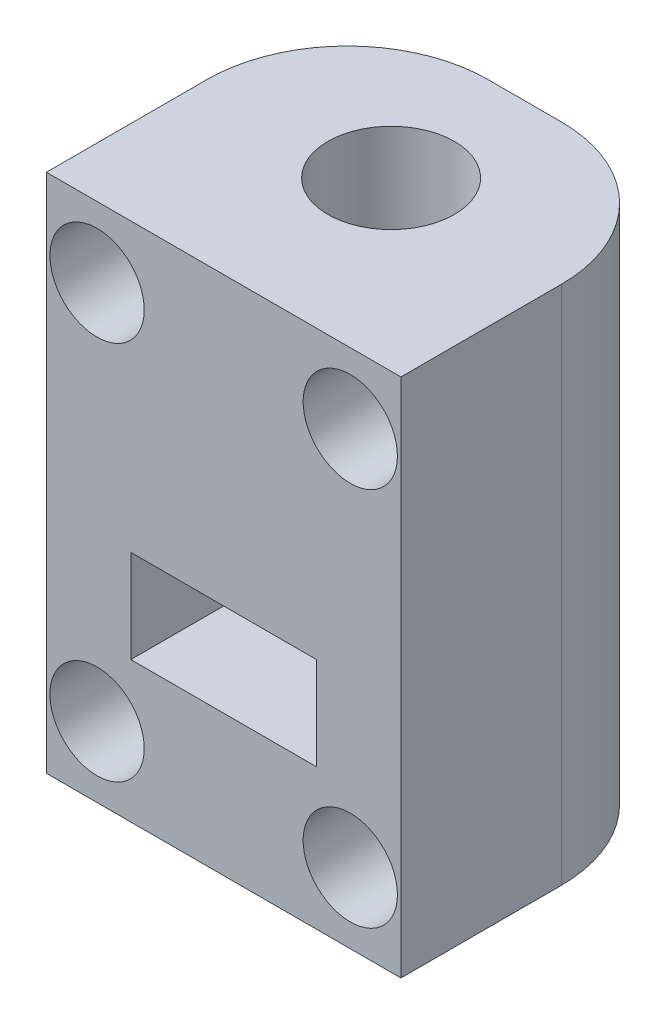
ISO-10303-21;
HEADER;
FILE_DESCRIPTION(('STEP AP214'),'2;1');
FILE_NAME('part.step','',(''),(''),'','','');
FILE_SCHEMA(('AUTOMOTIVE_DESIGN { 1 0 10303 214 1 1 1 1 }'));
ENDSEC;
DATA;
#1=APPLICATION_CONTEXT('core data for automotive mechanical design processes');
#2=APPLICATION_PROTOCOL_DEFINITION('international standard','automotive_design',2000,#1);
#3=PRODUCT_CONTEXT('',#1,'mechanical');
#4=PRODUCT('Part','Part','',(#3));
#5=PRODUCT_RELATED_PRODUCT_CATEGORY('part','',(#4));
#6=PRODUCT_DEFINITION_FORMATION('','',#4);
#7=PRODUCT_DEFINITION_CONTEXT('part definition',#1,'design');
#8=PRODUCT_DEFINITION('design','',#6,#7);
#9=PRODUCT_DEFINITION_SHAPE('','',#8);
#10=(LENGTH_UNIT() NAMED_UNIT(*) SI_UNIT(.MILLI.,.METRE.));
#11=(NAMED_UNIT(*) PLANE_ANGLE_UNIT() SI_UNIT($,.RADIAN.));
#12=(NAMED_UNIT(*) SI_UNIT($,.STERADIAN.) SOLID_ANGLE_UNIT());
#13=UNCERTAINTY_MEASURE_WITH_UNIT(LENGTH_MEASURE(1.E-05),#10,'distance_accuracy_value','');
#14=(GEOMETRIC_REPRESENTATION_CONTEXT(3) GLOBAL_UNCERTAINTY_ASSIGNED_CONTEXT((#13)) GLOBAL_UNIT_ASSIGNED_CONTEXT((#10,
#11,#12)) REPRESENTATION_CONTEXT('',''));
#15=CARTESIAN_POINT('',(0.,0.,0.));
#16=DIRECTION('',(0.,0.,1.));
#17=DIRECTION('',(1.,0.,0.));
#18=AXIS2_PLACEMENT_3D('',#15,#16,#17);
#19=CARTESIAN_POINT('',(0.,0.,21.4));
#20=DIRECTION('',(0.,0.,-1.));
#21=DIRECTION('',(-1.,0.,0.));
#22=AXIS2_PLACEMENT_3D('',#19,#20,#21);
#23=PLANE('',#22);
#24=CARTESIAN_POINT('',(21.6,5.,21.4));
#25=DIRECTION('',(0.,0.,1.));
#26=DIRECTION('',(1.,0.,0.));
#27=AXIS2_PLACEMENT_3D('',#24,#25,#26);
#28=CIRCLE('',#27,3.35);
#29=CARTESIAN_POINT('',(24.95,5.,21.4));
#30=VERTEX_POINT('',#29);
#31=EDGE_CURVE('E274',#30,#30,#28,.T.);
#32=ORIENTED_EDGE('',*,*,#31,.F.);
#33=EDGE_LOOP('',(#32));
#34=FACE_BOUND('',#33,.T.);
#35=CARTESIAN_POINT('',(3.6,5.,21.4));
#36=DIRECTION('',(0.,0.,1.));
#37=DIRECTION('',(1.,0.,0.));
#38=AXIS2_PLACEMENT_3D('',#35,#36,#37);
#39=CIRCLE('',#38,3.35);
#40=CARTESIAN_POINT('',(6.95,5.,21.4));
#41=VERTEX_POINT('',#40);
#42=EDGE_CURVE('E268',#41,#41,#39,.T.);
#43=ORIENTED_EDGE('',*,*,#42,.F.);
#44=EDGE_LOOP('',(#43));
#45=FACE_BOUND('',#44,.T.);
#46=CARTESIAN_POINT('',(21.6,32.,21.4));
#47=DIRECTION('',(0.,0.,1.));
#48=DIRECTION('',(1.,0.,0.));
#49=AXIS2_PLACEMENT_3D('',#46,#47,#48);
#50=CIRCLE('',#49,3.35);
#51=CARTESIAN_POINT('',(24.95,32.,21.4));
#52=VERTEX_POINT('',#51);
#53=EDGE_CURVE('E262',#52,#52,#50,.T.);
#54=ORIENTED_EDGE('',*,*,#53,.F.);
#55=EDGE_LOOP('',(#54));
#56=FACE_BOUND('',#55,.T.);
#57=CARTESIAN_POINT('',(3.6,32.,21.4));
#58=DIRECTION('',(0.,0.,1.));
#59=DIRECTION('',(1.,0.,0.));
#60=AXIS2_PLACEMENT_3D('',#57,#58,#59);
#61=CIRCLE('',#60,3.35);
#62=CARTESIAN_POINT('',(6.95,32.,21.4));
#63=VERTEX_POINT('',#62);
#64=EDGE_CURVE('E256',#63,#63,#61,.T.);
#65=ORIENTED_EDGE('',*,*,#64,.F.);
#66=EDGE_LOOP('',(#65));
#67=FACE_BOUND('',#66,.T.);
#68=DIRECTION('',(0.,-1.,0.));
#69=VECTOR('',#68,1.);
#70=CARTESIAN_POINT('',(0.,0.,21.4));
#71=LINE('',#70,#69);
#72=CARTESIAN_POINT('',(0.,37.,21.4));
#73=VERTEX_POINT('',#72);
#74=CARTESIAN_POINT('',(0.,0.,21.4));
#75=VERTEX_POINT('',#74);
#76=EDGE_CURVE('E169',#73,#75,#71,.T.);
#77=ORIENTED_EDGE('',*,*,#76,.T.);
#78=DIRECTION('',(1.,0.,0.));
#79=VECTOR('',#78,1.);
#80=CARTESIAN_POINT('',(0.,0.,21.4));
#81=LINE('',#80,#79);
#82=CARTESIAN_POINT('',(25.2,0.,21.4));
#83=VERTEX_POINT('',#82);
#84=EDGE_CURVE('E172',#75,#83,#81,.T.);
#85=ORIENTED_EDGE('',*,*,#84,.T.);
#86=DIRECTION('',(0.,1.,0.));
#87=VECTOR('',#86,1.);
#88=CARTESIAN_POINT('',(25.2,0.,21.4));
#89=LINE('',#88,#87);
#90=CARTESIAN_POINT('',(25.2,37.,21.4));
#91=VERTEX_POINT('',#90);
#92=EDGE_CURVE('E175',#83,#91,#89,.T.);
#93=ORIENTED_EDGE('',*,*,#92,.T.);
#94=DIRECTION('',(-1.,0.,0.));
#95=VECTOR('',#94,1.);
#96=CARTESIAN_POINT('',(0.,37.,21.4));
#97=LINE('',#96,#95);
#98=EDGE_CURVE('E177',#91,#73,#97,.T.);
#99=ORIENTED_EDGE('',*,*,#98,.T.);
#100=EDGE_LOOP('',(#77,#85,#93,#99));
#101=FACE_BOUND('',#100,.T.);
#102=DIRECTION('',(-1.,0.,0.));
#103=VECTOR('',#102,1.);
#104=CARTESIAN_POINT('',(0.,16.6,21.4));
#105=LINE('',#104,#103);
#106=CARTESIAN_POINT('',(19.2,16.6,21.4));
#107=VERTEX_POINT('',#106);
#108=CARTESIAN_POINT('',(5.99999999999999,16.6,21.4));
#109=VERTEX_POINT('',#108);
#110=EDGE_CURVE('E128',#107,#109,#105,.T.);
#111=ORIENTED_EDGE('',*,*,#110,.F.);
#112=DIRECTION('',(0.,-1.,0.));
#113=VECTOR('',#112,1.);
#114=CARTESIAN_POINT('',(19.2,0.,21.4));
#115=LINE('',#114,#113);
#116=CARTESIAN_POINT('',(19.2,10.,21.4));
#117=VERTEX_POINT('',#116);
#118=EDGE_CURVE('E198',#107,#117,#115,.T.);
#119=ORIENTED_EDGE('',*,*,#118,.T.);
#120=DIRECTION('',(-1.,0.,0.));
#121=VECTOR('',#120,1.);
#122=CARTESIAN_POINT('',(0.,10.,21.4));
#123=LINE('',#122,#121);
#124=CARTESIAN_POINT('',(5.99999999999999,10.,21.4));
#125=VERTEX_POINT('',#124);
#126=EDGE_CURVE('E162',#117,#125,#123,.T.);
#127=ORIENTED_EDGE('',*,*,#126,.T.);
#128=DIRECTION('',(0.,1.,0.));
#129=VECTOR('',#128,1.);
#130=CARTESIAN_POINT('',(6.,0.,21.4));
#131=LINE('',#130,#129);
#132=EDGE_CURVE('E194',#125,#109,#131,.T.);
#133=ORIENTED_EDGE('',*,*,#132,.T.);
#134=EDGE_LOOP('',(#111,#119,#127,#133));
#135=FACE_BOUND('',#134,.T.);
#136=ADVANCED_FACE('F35',(#34,#45,#56,#67,#101,#135),#23,.F.);
#137=CARTESIAN_POINT('',(0.,0.,21.4));
#138=DIRECTION('',(1.,0.,0.));
#139=DIRECTION('',(0.,0.,-1.));
#140=AXIS2_PLACEMENT_3D('',#137,#138,#139);
#141=PLANE('',#140);
#142=DIRECTION('',(0.,0.,-1.));
#143=VECTOR('',#142,1.);
#144=CARTESIAN_POINT('',(0.,37.,21.4));
#145=LINE('',#144,#143);
#146=CARTESIAN_POINT('',(0.,37.,10.));
#147=VERTEX_POINT('',#146);
#148=EDGE_CURVE('E179',#73,#147,#145,.T.);
#149=ORIENTED_EDGE('',*,*,#148,.T.);
#150=DIRECTION('',(0.,-1.,0.));
#151=VECTOR('',#150,1.);
#152=CARTESIAN_POINT('',(0.,0.,10.));
#153=LINE('',#152,#151);
#154=CARTESIAN_POINT('',(0.,0.,10.));
#155=VERTEX_POINT('',#154);
#156=EDGE_CURVE('E201',#147,#155,#153,.T.);
#157=ORIENTED_EDGE('',*,*,#156,.T.);
#158=DIRECTION('',(0.,0.,-1.));
#159=VECTOR('',#158,1.);
#160=CARTESIAN_POINT('',(0.,0.,21.4));
#161=LINE('',#160,#159);
#162=EDGE_CURVE('E191',#75,#155,#161,.T.);
#163=ORIENTED_EDGE('',*,*,#162,.F.);
#164=ORIENTED_EDGE('',*,*,#76,.F.);
#165=EDGE_LOOP('',(#149,#157,#163,#164));
#166=FACE_BOUND('',#165,.T.);
#167=ADVANCED_FACE('F223',(#166),#141,.F.);
#168=CARTESIAN_POINT('',(0.,0.,21.4));
#169=DIRECTION('',(0.,1.,0.));
#170=DIRECTION('',(0.,0.,1.));
#171=AXIS2_PLACEMENT_3D('',#168,#169,#170);
#172=PLANE('',#171);
#173=CARTESIAN_POINT('',(12.6,0.,9.5));
#174=DIRECTION('',(0.,-1.,0.));
#175=DIRECTION('',(0.,0.,-1.));
#176=AXIS2_PLACEMENT_3D('',#173,#174,#175);
#177=CIRCLE('',#176,4.5);
#178=CARTESIAN_POINT('',(12.6,0.,5.));
#179=VERTEX_POINT('',#178);
#180=EDGE_CURVE('E250',#179,#179,#177,.T.);
#181=ORIENTED_EDGE('',*,*,#180,.F.);
#182=EDGE_LOOP('',(#181));
#183=FACE_BOUND('',#182,.T.);
#184=ORIENTED_EDGE('',*,*,#162,.T.);
#185=CARTESIAN_POINT('',(10.,0.,10.));
#186=DIRECTION('',(0.,1.,0.));
#187=DIRECTION('',(0.,0.,1.));
#188=AXIS2_PLACEMENT_3D('',#185,#186,#187);
#189=CIRCLE('',#188,10.);
#190=CARTESIAN_POINT('',(10.,0.,0.));
#191=VERTEX_POINT('',#190);
#192=EDGE_CURVE('E209',#155,#191,#189,.F.);
#193=ORIENTED_EDGE('',*,*,#192,.T.);
#194=DIRECTION('',(1.,0.,0.));
#195=VECTOR('',#194,1.);
#196=CARTESIAN_POINT('',(0.,0.,0.));
#197=LINE('',#196,#195);
#198=CARTESIAN_POINT('',(15.2,0.,0.));
#199=VERTEX_POINT('',#198);
#200=EDGE_CURVE('E168',#191,#199,#197,.T.);
#201=ORIENTED_EDGE('',*,*,#200,.T.);
#202=CARTESIAN_POINT('',(15.2,0.,10.));
#203=DIRECTION('',(0.,1.,0.));
#204=DIRECTION('',(0.,0.,1.));
#205=AXIS2_PLACEMENT_3D('',#202,#203,#204);
#206=CIRCLE('',#205,10.);
#207=CARTESIAN_POINT('',(25.2,0.,10.));
#208=VERTEX_POINT('',#207);
#209=EDGE_CURVE('E207',#199,#208,#206,.F.);
#210=ORIENTED_EDGE('',*,*,#209,.T.);
#211=DIRECTION('',(0.,0.,-1.));
#212=VECTOR('',#211,1.);
#213=CARTESIAN_POINT('',(25.2,0.,21.4));
#214=LINE('',#213,#212);
#215=EDGE_CURVE('E188',#83,#208,#214,.T.);
#216=ORIENTED_EDGE('',*,*,#215,.F.);
#217=ORIENTED_EDGE('',*,*,#84,.F.);
#218=EDGE_LOOP('',(#184,#193,#201,#210,#216,#217));
#219=FACE_BOUND('',#218,.T.);
#220=ADVANCED_FACE('F227',(#183,#219),#172,.F.);
#221=CARTESIAN_POINT('',(25.2,0.,21.4));
#222=DIRECTION('',(-1.,0.,0.));
#223=DIRECTION('',(0.,0.,1.));
#224=AXIS2_PLACEMENT_3D('',#221,#222,#223);
#225=PLANE('',#224);
#226=ORIENTED_EDGE('',*,*,#215,.T.);
#227=DIRECTION('',(0.,1.,0.));
#228=VECTOR('',#227,1.);
#229=CARTESIAN_POINT('',(25.2,37.,10.));
#230=LINE('',#229,#228);
#231=CARTESIAN_POINT('',(25.2,37.,10.));
#232=VERTEX_POINT('',#231);
#233=EDGE_CURVE('E11',#208,#232,#230,.T.);
#234=ORIENTED_EDGE('',*,*,#233,.T.);
#235=DIRECTION('',(0.,0.,-1.));
#236=VECTOR('',#235,1.);
#237=CARTESIAN_POINT('',(25.2,37.,21.4));
#238=LINE('',#237,#236);
#239=EDGE_CURVE('E185',#91,#232,#238,.T.);
#240=ORIENTED_EDGE('',*,*,#239,.F.);
#241=ORIENTED_EDGE('',*,*,#92,.F.);
#242=EDGE_LOOP('',(#226,#234,#240,#241));
#243=FACE_BOUND('',#242,.T.);
#244=ADVANCED_FACE('F233',(#243),#225,.F.);
#245=CARTESIAN_POINT('',(0.,37.,21.4));
#246=DIRECTION('',(0.,-1.,0.));
#247=DIRECTION('',(0.,0.,-1.));
#248=AXIS2_PLACEMENT_3D('',#245,#246,#247);
#249=PLANE('',#248);
#250=CARTESIAN_POINT('',(12.6,37.,9.5));
#251=DIRECTION('',(0.,-1.,0.));
#252=DIRECTION('',(0.,0.,-1.));
#253=AXIS2_PLACEMENT_3D('',#250,#251,#252);
#254=CIRCLE('',#253,4.5);
#255=CARTESIAN_POINT('',(12.6,37.,5.));
#256=VERTEX_POINT('',#255);
#257=EDGE_CURVE('E204',#256,#256,#254,.T.);
#258=ORIENTED_EDGE('',*,*,#257,.T.);
#259=EDGE_LOOP('',(#258));
#260=FACE_BOUND('',#259,.T.);
#261=DIRECTION('',(-1.,0.,0.));
#262=VECTOR('',#261,1.);
#263=CARTESIAN_POINT('',(0.,37.,0.));
#264=LINE('',#263,#262);
#265=CARTESIAN_POINT('',(15.2,37.,0.));
#266=VERTEX_POINT('',#265);
#267=CARTESIAN_POINT('',(10.,37.,0.));
#268=VERTEX_POINT('',#267);
#269=EDGE_CURVE('E173',#266,#268,#264,.T.);
#270=ORIENTED_EDGE('',*,*,#269,.T.);
#271=CARTESIAN_POINT('',(10.,37.,10.));
#272=DIRECTION('',(0.,-1.,0.));
#273=DIRECTION('',(0.,0.,-1.));
#274=AXIS2_PLACEMENT_3D('',#271,#272,#273);
#275=CIRCLE('',#274,10.);
#276=EDGE_CURVE('E43',#268,#147,#275,.F.);
#277=ORIENTED_EDGE('',*,*,#276,.T.);
#278=ORIENTED_EDGE('',*,*,#148,.F.);
#279=ORIENTED_EDGE('',*,*,#98,.F.);
#280=ORIENTED_EDGE('',*,*,#239,.T.);
#281=CARTESIAN_POINT('',(15.2,37.,10.));
#282=DIRECTION('',(0.,-1.,0.));
#283=DIRECTION('',(0.,0.,-1.));
#284=AXIS2_PLACEMENT_3D('',#281,#282,#283);
#285=CIRCLE('',#284,10.);
#286=EDGE_CURVE('E50',#232,#266,#285,.F.);
#287=ORIENTED_EDGE('',*,*,#286,.T.);
#288=EDGE_LOOP('',(#270,#277,#278,#279,#280,#287));
#289=FACE_BOUND('',#288,.T.);
#290=ADVANCED_FACE('F217',(#260,#289),#249,.F.);
#291=CARTESIAN_POINT('',(0.,0.,0.));
#292=DIRECTION('',(0.,0.,-1.));
#293=DIRECTION('',(-1.,0.,0.));
#294=AXIS2_PLACEMENT_3D('',#291,#292,#293);
#295=PLANE('',#294);
#296=ORIENTED_EDGE('',*,*,#200,.F.);
#297=DIRECTION('',(0.,-1.,0.));
#298=VECTOR('',#297,1.);
#299=CARTESIAN_POINT('',(10.,37.,0.));
#300=LINE('',#299,#298);
#301=EDGE_CURVE('E57',#191,#268,#300,.F.);
#302=ORIENTED_EDGE('',*,*,#301,.T.);
#303=ORIENTED_EDGE('',*,*,#269,.F.);
#304=DIRECTION('',(0.,1.,0.));
#305=VECTOR('',#304,1.);
#306=CARTESIAN_POINT('',(15.2,0.,0.));
#307=LINE('',#306,#305);
#308=EDGE_CURVE('E211',#266,#199,#307,.F.);
#309=ORIENTED_EDGE('',*,*,#308,.T.);
#310=EDGE_LOOP('',(#296,#302,#303,#309));
#311=FACE_BOUND('',#310,.T.);
#312=ADVANCED_FACE('F229',(#311),#295,.T.);
#313=CARTESIAN_POINT('',(19.2,16.6,5.68948822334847));
#314=DIRECTION('',(1.,0.,0.));
#315=DIRECTION('',(0.,0.,-1.));
#316=AXIS2_PLACEMENT_3D('',#313,#314,#315);
#317=PLANE('',#316);
#318=DIRECTION('',(0.,0.,1.));
#319=VECTOR('',#318,1.);
#320=CARTESIAN_POINT('',(19.2,16.6,23.2181195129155));
#321=LINE('',#320,#319);
#322=CARTESIAN_POINT('',(19.2,16.6,5.68948822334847));
#323=VERTEX_POINT('',#322);
#324=EDGE_CURVE('E132',#323,#107,#321,.T.);
#325=ORIENTED_EDGE('',*,*,#324,.F.);
#326=DIRECTION('',(0.,-1.,0.));
#327=VECTOR('',#326,1.);
#328=CARTESIAN_POINT('',(19.2,16.6,5.68948822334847));
#329=LINE('',#328,#327);
#330=CARTESIAN_POINT('',(19.2,10.,5.68948822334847));
#331=VERTEX_POINT('',#330);
#332=EDGE_CURVE('E160',#323,#331,#329,.T.);
#333=ORIENTED_EDGE('',*,*,#332,.T.);
#334=DIRECTION('',(0.,0.,1.));
#335=VECTOR('',#334,1.);
#336=CARTESIAN_POINT('',(19.2,10.,5.68948822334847));
#337=LINE('',#336,#335);
#338=EDGE_CURVE('E157',#331,#117,#337,.T.);
#339=ORIENTED_EDGE('',*,*,#338,.T.);
#340=ORIENTED_EDGE('',*,*,#118,.F.);
#341=EDGE_LOOP('',(#325,#333,#339,#340));
#342=FACE_BOUND('',#341,.T.);
#343=ADVANCED_FACE('F245',(#342),#317,.F.);
#344=CARTESIAN_POINT('',(5.99999999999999,16.6,13.3105117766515));
#345=DIRECTION('',(-1.,0.,0.));
#346=DIRECTION('',(0.,0.,1.));
#347=AXIS2_PLACEMENT_3D('',#344,#345,#346);
#348=PLANE('',#347);
#349=DIRECTION('',(0.,0.,-1.));
#350=VECTOR('',#349,1.);
#351=CARTESIAN_POINT('',(5.99999999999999,10.,13.3105117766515));
#352=LINE('',#351,#350);
#353=CARTESIAN_POINT('',(5.99999999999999,10.,5.68948822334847));
#354=VERTEX_POINT('',#353);
#355=EDGE_CURVE('E137',#125,#354,#352,.T.);
#356=ORIENTED_EDGE('',*,*,#355,.T.);
#357=DIRECTION('',(0.,-1.,0.));
#358=VECTOR('',#357,1.);
#359=CARTESIAN_POINT('',(5.99999999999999,16.6,5.68948822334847));
#360=LINE('',#359,#358);
#361=CARTESIAN_POINT('',(5.99999999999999,16.6,5.68948822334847));
#362=VERTEX_POINT('',#361);
#363=EDGE_CURVE('E135',#362,#354,#360,.T.);
#364=ORIENTED_EDGE('',*,*,#363,.F.);
#365=DIRECTION('',(0.,0.,-1.));
#366=VECTOR('',#365,1.);
#367=CARTESIAN_POINT('',(5.99999999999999,16.6,13.3105117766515));
#368=LINE('',#367,#366);
#369=EDGE_CURVE('E120',#109,#362,#368,.T.);
#370=ORIENTED_EDGE('',*,*,#369,.F.);
#371=ORIENTED_EDGE('',*,*,#132,.F.);
#372=EDGE_LOOP('',(#356,#364,#370,#371));
#373=FACE_BOUND('',#372,.T.);
#374=ADVANCED_FACE('F136',(#373),#348,.F.);
#375=CARTESIAN_POINT('',(0.,16.6,0.));
#376=DIRECTION('',(0.,-1.,0.));
#377=DIRECTION('',(0.,0.,-1.));
#378=AXIS2_PLACEMENT_3D('',#375,#376,#377);
#379=PLANE('',#378);
#380=CARTESIAN_POINT('',(12.6,16.6,9.5));
#381=DIRECTION('',(0.,-1.,0.));
#382=DIRECTION('',(0.,0.,-1.));
#383=AXIS2_PLACEMENT_3D('',#380,#381,#382);
#384=CIRCLE('',#383,4.5);
#385=CARTESIAN_POINT('',(12.6,16.6,5.));
#386=VERTEX_POINT('',#385);
#387=EDGE_CURVE('E166',#386,#386,#384,.F.);
#388=ORIENTED_EDGE('',*,*,#387,.T.);
#389=EDGE_LOOP('',(#388));
#390=FACE_BOUND('',#389,.T.);
#391=ORIENTED_EDGE('',*,*,#110,.T.);
#392=ORIENTED_EDGE('',*,*,#369,.T.);
#393=DIRECTION('',(0.866025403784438,0.,-0.5));
#394=VECTOR('',#393,1.);
#395=CARTESIAN_POINT('',(5.99999999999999,16.6,5.68948822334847));
#396=LINE('',#395,#394);
#397=CARTESIAN_POINT('',(12.6,16.6,1.87897644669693));
#398=VERTEX_POINT('',#397);
#399=EDGE_CURVE('E125',#362,#398,#396,.T.);
#400=ORIENTED_EDGE('',*,*,#399,.T.);
#401=DIRECTION('',(0.866025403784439,0.,0.5));
#402=VECTOR('',#401,1.);
#403=CARTESIAN_POINT('',(12.6,16.6,1.87897644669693));
#404=LINE('',#403,#402);
#405=EDGE_CURVE('E142',#398,#323,#404,.T.);
#406=ORIENTED_EDGE('',*,*,#405,.T.);
#407=ORIENTED_EDGE('',*,*,#324,.T.);
#408=EDGE_LOOP('',(#391,#392,#400,#406,#407));
#409=FACE_BOUND('',#408,.T.);
#410=ADVANCED_FACE('F122',(#390,#409),#379,.T.);
#411=CARTESIAN_POINT('',(12.6,16.6,1.87897644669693));
#412=DIRECTION('',(0.5,0.,-0.866025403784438));
#413=DIRECTION('',(-0.866025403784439,0.,-0.5));
#414=AXIS2_PLACEMENT_3D('',#411,#412,#413);
#415=PLANE('',#414);
#416=DIRECTION('',(0.866025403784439,0.,0.5));
#417=VECTOR('',#416,1.);
#418=CARTESIAN_POINT('',(12.6,10.,1.87897644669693));
#419=LINE('',#418,#417);
#420=CARTESIAN_POINT('',(12.6,10.,1.87897644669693));
#421=VERTEX_POINT('',#420);
#422=EDGE_CURVE('E154',#421,#331,#419,.T.);
#423=ORIENTED_EDGE('',*,*,#422,.T.);
#424=ORIENTED_EDGE('',*,*,#332,.F.);
#425=ORIENTED_EDGE('',*,*,#405,.F.);
#426=DIRECTION('',(0.,-1.,0.));
#427=VECTOR('',#426,1.);
#428=CARTESIAN_POINT('',(12.6,16.6,1.87897644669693));
#429=LINE('',#428,#427);
#430=EDGE_CURVE('E141',#398,#421,#429,.T.);
#431=ORIENTED_EDGE('',*,*,#430,.T.);
#432=EDGE_LOOP('',(#423,#424,#425,#431));
#433=FACE_BOUND('',#432,.T.);
#434=ADVANCED_FACE('F248',(#433),#415,.F.);
#435=CARTESIAN_POINT('',(5.99999999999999,16.6,5.68948822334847));
#436=DIRECTION('',(-0.5,0.,-0.866025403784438));
#437=DIRECTION('',(-0.866025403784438,0.,0.5));
#438=AXIS2_PLACEMENT_3D('',#435,#436,#437);
#439=PLANE('',#438);
#440=DIRECTION('',(0.866025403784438,0.,-0.5));
#441=VECTOR('',#440,1.);
#442=CARTESIAN_POINT('',(5.99999999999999,10.,5.68948822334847));
#443=LINE('',#442,#441);
#444=EDGE_CURVE('E151',#354,#421,#443,.T.);
#445=ORIENTED_EDGE('',*,*,#444,.T.);
#446=ORIENTED_EDGE('',*,*,#430,.F.);
#447=ORIENTED_EDGE('',*,*,#399,.F.);
#448=ORIENTED_EDGE('',*,*,#363,.T.);
#449=EDGE_LOOP('',(#445,#446,#447,#448));
#450=FACE_BOUND('',#449,.T.);
#451=ADVANCED_FACE('F144',(#450),#439,.F.);
#452=CARTESIAN_POINT('',(12.6,28.,9.5));
#453=DIRECTION('',(0.,-1.,0.));
#454=DIRECTION('',(0.,0.,-1.));
#455=AXIS2_PLACEMENT_3D('',#452,#453,#454);
#456=CYLINDRICAL_SURFACE('',#455,4.5);
#457=ORIENTED_EDGE('',*,*,#387,.F.);
#458=EDGE_LOOP('',(#457));
#459=FACE_BOUND('',#458,.T.);
#460=ORIENTED_EDGE('',*,*,#257,.F.);
#461=EDGE_LOOP('',(#460));
#462=FACE_BOUND('',#461,.T.);
#463=ADVANCED_FACE('F323',(#459,#462),#456,.F.);
#464=CARTESIAN_POINT('',(12.6,10.,9.5));
#465=DIRECTION('',(0.,-1.,0.));
#466=DIRECTION('',(0.,0.,-1.));
#467=AXIS2_PLACEMENT_3D('',#464,#465,#466);
#468=PLANE('',#467);
#469=CARTESIAN_POINT('',(12.6,10.,9.5));
#470=DIRECTION('',(0.,-1.,0.));
#471=DIRECTION('',(0.,0.,-1.));
#472=AXIS2_PLACEMENT_3D('',#469,#470,#471);
#473=CIRCLE('',#472,4.5);
#474=CARTESIAN_POINT('',(12.6,10.,5.));
#475=VERTEX_POINT('',#474);
#476=EDGE_CURVE('E152',#475,#475,#473,.T.);
#477=ORIENTED_EDGE('',*,*,#476,.T.);
#478=EDGE_LOOP('',(#477));
#479=FACE_BOUND('',#478,.T.);
#480=ORIENTED_EDGE('',*,*,#338,.F.);
#481=ORIENTED_EDGE('',*,*,#422,.F.);
#482=ORIENTED_EDGE('',*,*,#444,.F.);
#483=ORIENTED_EDGE('',*,*,#355,.F.);
#484=ORIENTED_EDGE('',*,*,#126,.F.);
#485=EDGE_LOOP('',(#480,#481,#482,#483,#484));
#486=FACE_BOUND('',#485,.T.);
#487=ADVANCED_FACE('F242',(#479,#486),#468,.F.);
#488=CARTESIAN_POINT('',(12.6,37.,9.5));
#489=DIRECTION('',(0.,-1.,0.));
#490=DIRECTION('',(0.,0.,-1.));
#491=AXIS2_PLACEMENT_3D('',#488,#489,#490);
#492=CYLINDRICAL_SURFACE('',#491,4.5);
#493=ORIENTED_EDGE('',*,*,#180,.T.);
#494=EDGE_LOOP('',(#493));
#495=FACE_BOUND('',#494,.T.);
#496=ORIENTED_EDGE('',*,*,#476,.F.);
#497=EDGE_LOOP('',(#496));
#498=FACE_BOUND('',#497,.T.);
#499=ADVANCED_FACE('F310',(#495,#498),#492,.F.);
#500=CARTESIAN_POINT('',(10.,0.,10.));
#501=DIRECTION('',(0.,1.,0.));
#502=DIRECTION('',(0.,0.,1.));
#503=AXIS2_PLACEMENT_3D('',#500,#501,#502);
#504=CYLINDRICAL_SURFACE('',#503,10.);
#505=ORIENTED_EDGE('',*,*,#276,.F.);
#506=ORIENTED_EDGE('',*,*,#301,.F.);
#507=ORIENTED_EDGE('',*,*,#192,.F.);
#508=ORIENTED_EDGE('',*,*,#156,.F.);
#509=EDGE_LOOP('',(#505,#506,#507,#508));
#510=FACE_BOUND('',#509,.T.);
#511=ADVANCED_FACE('F225',(#510),#504,.T.);
#512=CARTESIAN_POINT('',(15.2,0.,10.));
#513=DIRECTION('',(0.,-1.,0.));
#514=DIRECTION('',(0.,0.,-1.));
#515=AXIS2_PLACEMENT_3D('',#512,#513,#514);
#516=CYLINDRICAL_SURFACE('',#515,10.);
#517=ORIENTED_EDGE('',*,*,#209,.F.);
#518=ORIENTED_EDGE('',*,*,#308,.F.);
#519=ORIENTED_EDGE('',*,*,#286,.F.);
#520=ORIENTED_EDGE('',*,*,#233,.F.);
#521=EDGE_LOOP('',(#517,#518,#519,#520));
#522=FACE_BOUND('',#521,.T.);
#523=ADVANCED_FACE('F37',(#522),#516,.T.);
#524=CARTESIAN_POINT('',(3.6,32.,11.4));
#525=DIRECTION('',(0.,0.,1.));
#526=DIRECTION('',(1.,0.,0.));
#527=AXIS2_PLACEMENT_3D('',#524,#525,#526);
#528=CYLINDRICAL_SURFACE('',#527,3.35);
#529=CARTESIAN_POINT('',(3.6,32.,11.4));
#530=DIRECTION('',(0.,0.,1.));
#531=DIRECTION('',(1.,0.,0.));
#532=AXIS2_PLACEMENT_3D('',#529,#530,#531);
#533=CIRCLE('',#532,3.35);
#534=CARTESIAN_POINT('',(6.95,32.,11.4));
#535=VERTEX_POINT('',#534);
#536=EDGE_CURVE('E253',#535,#535,#533,.T.);
#537=ORIENTED_EDGE('',*,*,#536,.F.);
#538=EDGE_LOOP('',(#537));
#539=FACE_BOUND('',#538,.T.);
#540=ORIENTED_EDGE('',*,*,#64,.T.);
#541=EDGE_LOOP('',(#540));
#542=FACE_BOUND('',#541,.T.);
#543=ADVANCED_FACE('F295',(#539,#542),#528,.F.);
#544=CARTESIAN_POINT('',(3.6,32.,11.4));
#545=DIRECTION('',(0.,0.,1.));
#546=DIRECTION('',(1.,0.,0.));
#547=AXIS2_PLACEMENT_3D('',#544,#545,#546);
#548=PLANE('',#547);
#549=ORIENTED_EDGE('',*,*,#536,.T.);
#550=EDGE_LOOP('',(#549));
#551=FACE_BOUND('',#550,.T.);
#552=ADVANCED_FACE('F297',(#551),#548,.T.);
#553=CARTESIAN_POINT('',(21.6,32.,11.4));
#554=DIRECTION('',(0.,0.,1.));
#555=DIRECTION('',(1.,0.,0.));
#556=AXIS2_PLACEMENT_3D('',#553,#554,#555);
#557=CYLINDRICAL_SURFACE('',#556,3.35);
#558=CARTESIAN_POINT('',(21.6,32.,11.4));
#559=DIRECTION('',(0.,0.,1.));
#560=DIRECTION('',(1.,0.,0.));
#561=AXIS2_PLACEMENT_3D('',#558,#559,#560);
#562=CIRCLE('',#561,3.35);
#563=CARTESIAN_POINT('',(24.95,32.,11.4));
#564=VERTEX_POINT('',#563);
#565=EDGE_CURVE('E259',#564,#564,#562,.T.);
#566=ORIENTED_EDGE('',*,*,#565,.F.);
#567=EDGE_LOOP('',(#566));
#568=FACE_BOUND('',#567,.T.);
#569=ORIENTED_EDGE('',*,*,#53,.T.);
#570=EDGE_LOOP('',(#569));
#571=FACE_BOUND('',#570,.T.);
#572=ADVANCED_FACE('F304',(#568,#571),#557,.F.);
#573=CARTESIAN_POINT('',(21.6,32.,11.4));
#574=DIRECTION('',(0.,0.,1.));
#575=DIRECTION('',(1.,0.,0.));
#576=AXIS2_PLACEMENT_3D('',#573,#574,#575);
#577=PLANE('',#576);
#578=ORIENTED_EDGE('',*,*,#565,.T.);
#579=EDGE_LOOP('',(#578));
#580=FACE_BOUND('',#579,.T.);
#581=ADVANCED_FACE('F380',(#580),#577,.T.);
#582=CARTESIAN_POINT('',(3.6,5.,11.4));
#583=DIRECTION('',(0.,0.,1.));
#584=DIRECTION('',(1.,0.,0.));
#585=AXIS2_PLACEMENT_3D('',#582,#583,#584);
#586=CYLINDRICAL_SURFACE('',#585,3.35);
#587=CARTESIAN_POINT('',(3.6,5.,11.4));
#588=DIRECTION('',(0.,0.,1.));
#589=DIRECTION('',(1.,0.,0.));
#590=AXIS2_PLACEMENT_3D('',#587,#588,#589);
#591=CIRCLE('',#590,3.35);
#592=CARTESIAN_POINT('',(6.95,5.,11.4));
#593=VERTEX_POINT('',#592);
#594=EDGE_CURVE('E265',#593,#593,#591,.T.);
#595=ORIENTED_EDGE('',*,*,#594,.F.);
#596=EDGE_LOOP('',(#595));
#597=FACE_BOUND('',#596,.T.);
#598=ORIENTED_EDGE('',*,*,#42,.T.);
#599=EDGE_LOOP('',(#598));
#600=FACE_BOUND('',#599,.T.);
#601=ADVANCED_FACE('F389',(#597,#600),#586,.F.);
#602=CARTESIAN_POINT('',(3.6,5.,11.4));
#603=DIRECTION('',(0.,0.,1.));
#604=DIRECTION('',(1.,0.,0.));
#605=AXIS2_PLACEMENT_3D('',#602,#603,#604);
#606=PLANE('',#605);
#607=ORIENTED_EDGE('',*,*,#594,.T.);
#608=EDGE_LOOP('',(#607));
#609=FACE_BOUND('',#608,.T.);
#610=ADVANCED_FACE('F285',(#609),#606,.T.);
#611=CARTESIAN_POINT('',(21.6,5.,11.4));
#612=DIRECTION('',(0.,0.,1.));
#613=DIRECTION('',(1.,0.,0.));
#614=AXIS2_PLACEMENT_3D('',#611,#612,#613);
#615=CYLINDRICAL_SURFACE('',#614,3.35);
#616=CARTESIAN_POINT('',(21.6,5.,11.4));
#617=DIRECTION('',(0.,0.,1.));
#618=DIRECTION('',(1.,0.,0.));
#619=AXIS2_PLACEMENT_3D('',#616,#617,#618);
#620=CIRCLE('',#619,3.35);
#621=CARTESIAN_POINT('',(24.95,5.,11.4));
#622=VERTEX_POINT('',#621);
#623=EDGE_CURVE('E271',#622,#622,#620,.T.);
#624=ORIENTED_EDGE('',*,*,#623,.F.);
#625=EDGE_LOOP('',(#624));
#626=FACE_BOUND('',#625,.T.);
#627=ORIENTED_EDGE('',*,*,#31,.T.);
#628=EDGE_LOOP('',(#627));
#629=FACE_BOUND('',#628,.T.);
#630=ADVANCED_FACE('F282',(#626,#629),#615,.F.);
#631=CARTESIAN_POINT('',(21.6,5.,11.4));
#632=DIRECTION('',(0.,0.,1.));
#633=DIRECTION('',(1.,0.,0.));
#634=AXIS2_PLACEMENT_3D('',#631,#632,#633);
#635=PLANE('',#634);
#636=ORIENTED_EDGE('',*,*,#623,.T.);
#637=EDGE_LOOP('',(#636));
#638=FACE_BOUND('',#637,.T.);
#639=ADVANCED_FACE('F280',(#638),#635,.T.);
#640=CLOSED_SHELL('',(#136,#167,#220,#244,#290,#312,#343,#374,#410,#434,#451,#463,#487,#499,
#511,#523,#543,#552,#572,#581,#601,#610,#630,#639));
#641=MANIFOLD_SOLID_BREP('B2',#640);
#642=ADVANCED_BREP_SHAPE_REPRESENTATION('',(#18,#641),#14);
#643=SHAPE_DEFINITION_REPRESENTATION(#9,#642);
ENDSEC;
END-ISO-10303-21;
